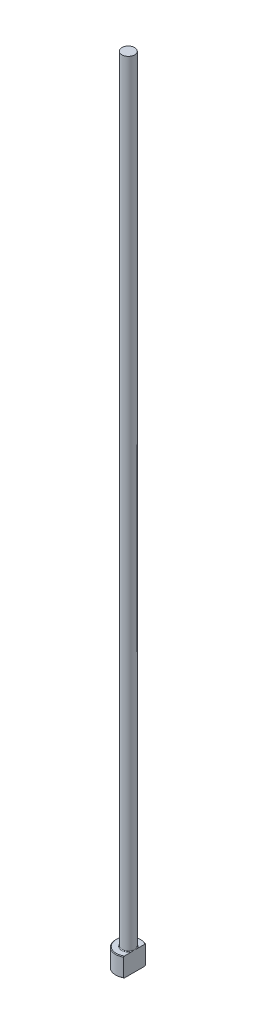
from build123d import *
from build123d.topology import SkipClean

# Parameters (mm, degrees)
CHAMFER1_SIZE    = 0.2
FILLET1_R        = 0.2
KEYED_HEAD_DEPTH = 251.06399181


with BuildPart() as part:
    # Sketch1 → Revolve1 (revolve)
    with BuildSketch(Plane.XY, mode=Mode.PRIVATE) as revolve1_sk:
        Polygon((0, 0), (-4, 0), (-4, 6), (-2, 6), (-2, 250), (0, 250), align=None)
    revolve(revolve1_sk.sketch.rotate(Axis((0, 259.958771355, 0), (0, -1, 0)), 270), axis=Axis((0, 259.958771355, 0), (0, -1, 0)))

    # Chamfer1
    chamfer1_edges = [part.edges().sort_by_distance(p)[0] for p in [
        (0, 6, -4),
        (0, 0, -4),
    ]]
    chamfer(chamfer1_edges, length=CHAMFER1_SIZE)

    # Fillet1
    fillet1_edges = [part.edges().sort_by_distance(p)[0] for p in [
        (0, 6, -2),
    ]]
    fillet(fillet1_edges, radius=FILLET1_R)

    # Sketch2 → KEYED HEAD (cut, through all)
    with SkipClean():  # the faces are left unmerged after this step: merging them gives an invalid solid
        with BuildSketch(Plane(origin=(0, 0, 0), x_dir=(1, 0, 0), z_dir=(0, 1, 0))):
            with BuildLine():
                Line((2, -3.464101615), (2, 3.464101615))
                ThreePointArc((2, 3.464101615), (4, 0), (2, -3.464101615))
            make_face()
        extrude(amount=KEYED_HEAD_DEPTH, mode=Mode.SUBTRACT)


solid = part.part
